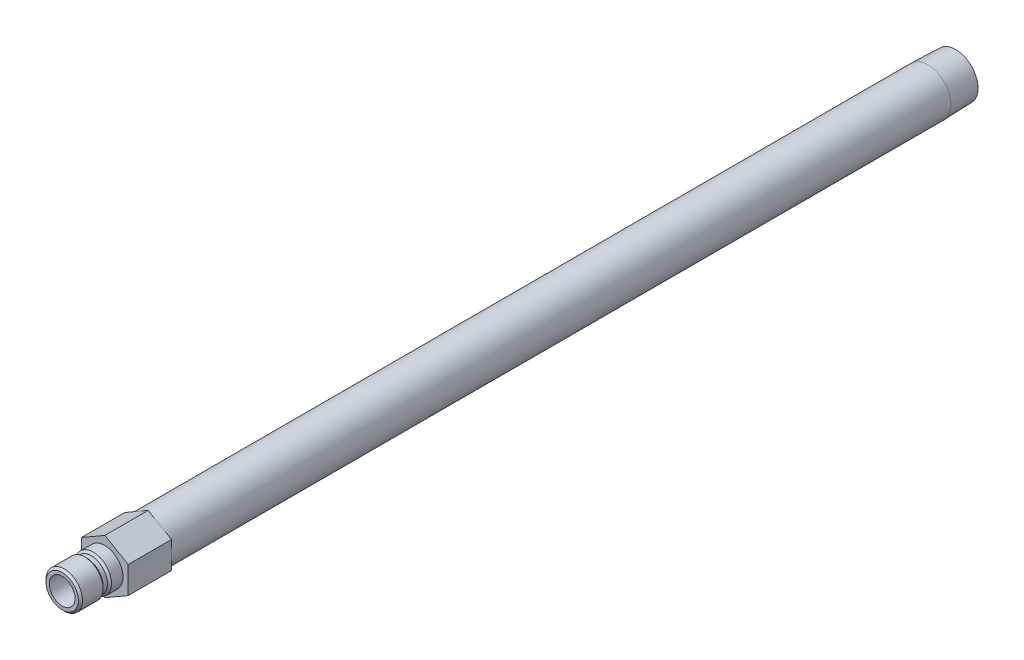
from build123d import *

# Parameters (mm, degrees)
SKETCH2_R           = 4.7625
BOSS_EXTRUDE1_DEPTH = 16.002


with BuildPart() as part:
    # Sketch1 → Revolve1 (revolve)
    with BuildSketch(Plane(origin=(0, 0, 0), x_dir=(0, 0, -1), z_dir=(1, 0, 0))):
        Polygon((-15.748, 4.7625), (-15.748, 5.9817), (-14.986, 6.7437), (-7.366, 6.7437), (-6.604, 5.9817), (-5.0165, 5.9817), (-4.2545, 6.7437), (0, 6.7437), (0, 8.5725), (304.1142, 8.5725), (314.452, 8.249445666), (314.452, 6.2611), (16.002, 6.2611), (16.002, 4.7625), align=None)
    revolve(axis=Axis((0, 0, 0), (0, 0, 1)))

    # Sketch2 → Boss-Extrude1 (add)
    with BuildSketch(Plane.XY):
        Polygon((-8.636, 4.985996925), (-8.636, -4.985996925), (0, -9.971993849), (8.636, -4.985996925), (8.636, 4.985996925), (0, 9.971993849), align=None)
        with Locations(Location((0, 0, 0), (0, 0, 90))):
            Circle(SKETCH2_R, mode=Mode.SUBTRACT)
    extrude(amount=-BOSS_EXTRUDE1_DEPTH)


solid = part.part
